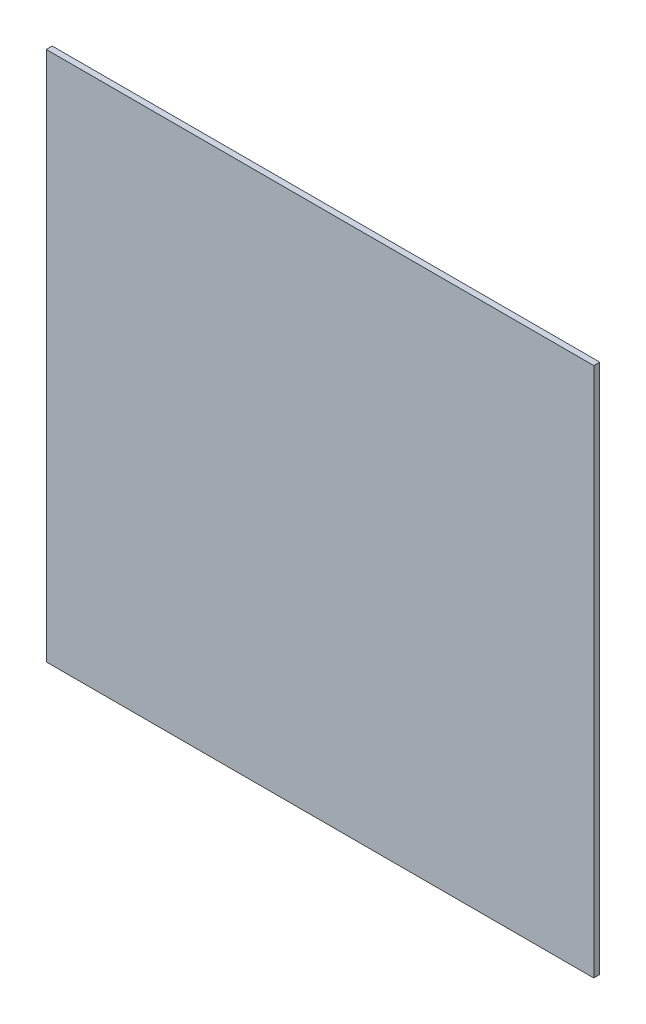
from build123d import *

# Parameters (mm, degrees)
SKETCH1_W           = 96
SKETCH1_H           = 93
BOSS_EXTRUDE1_DEPTH = 1.05


with BuildPart() as part:
    # Sketch1 → Boss-Extrude1 (new body)
    with BuildSketch(Plane.XY):
        Rectangle(SKETCH1_W, SKETCH1_H)
    extrude(amount=BOSS_EXTRUDE1_DEPTH)


solid = part.part
